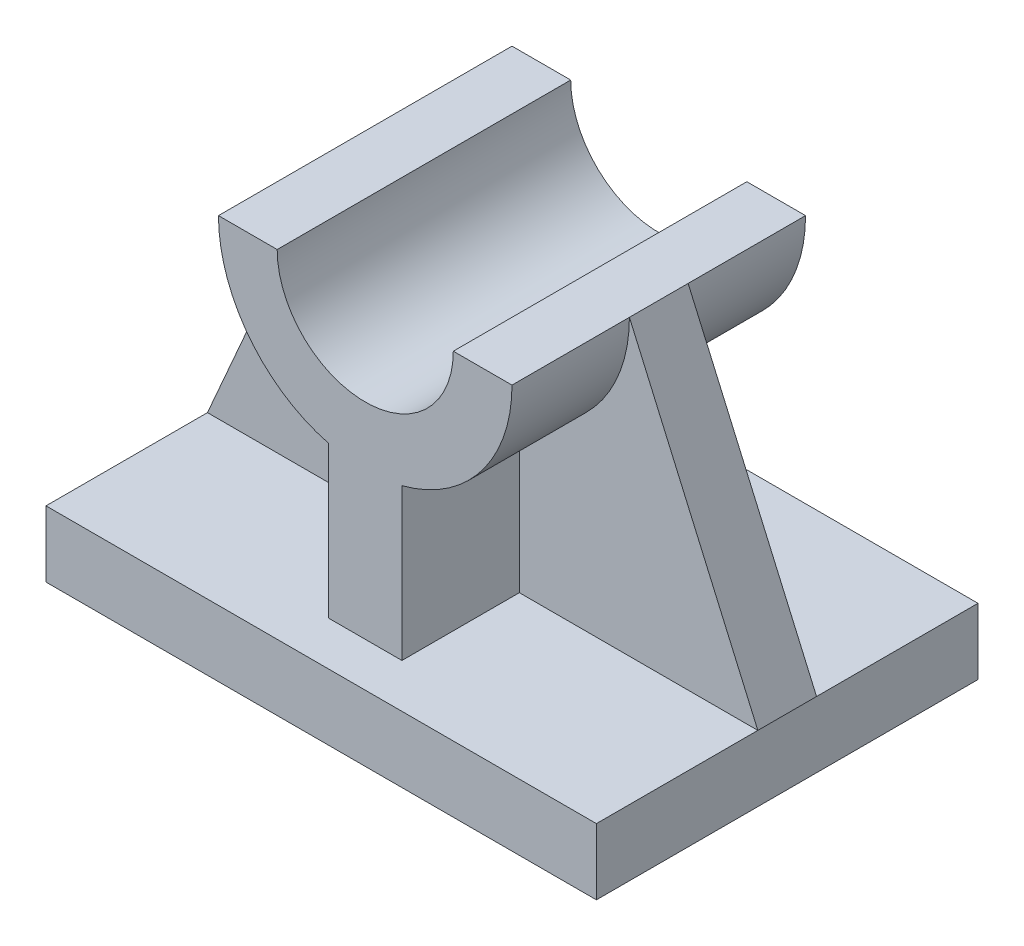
from build123d import *

# Parameters (mm, degrees)
EXTRUDE1_DEPTH = 26
EXTRUDE2_DEPTH = 20
EXTRUDE3_DEPTH = 4


with BuildPart() as part:
    # Sketch1 → Extrude1 (new, symmetric)
    with BuildSketch(Plane.XY):
        Polygon((-5, 0), (5, 0), (37.5, 0), (37.5, -9), (-37.5, -9), (-37.5, 0), align=None)
    extrude(amount=EXTRUDE1_DEPTH, both=True)

    # Sketch1_3 → Extrude2 (add, symmetric)
    with BuildSketch(Plane.XY):
        with BuildLine():
            Line((5, 0), (5, 20.635083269))
            ThreePointArc((5, 20.635083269), (15.811388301, 27.752551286), (20, 40))
            Line((20, 40), (12, 40))
            ThreePointArc((12, 40), (0, 28), (-12, 40))
            Line((-12, 40), (-20, 40))
            ThreePointArc((-20, 40), (-15.811388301, 27.752551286), (-5, 20.635083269))
            Line((-5, 20.635083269), (-5, 0))
            Line((-5, 0), (5, 0))
        make_face()
    extrude(amount=EXTRUDE2_DEPTH, both=True)

    # Sketch1_4 → Extrude3 (add, symmetric)
    with BuildSketch(Plane.XY):
        with BuildLine():
            ThreePointArc((5, 20.635083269), (15.811388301, 27.752551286), (20, 40))
            Line((20, 40), (37.5, 0))
            Line((37.5, 0), (5, 0))
            Line((5, 0), (5, 20.635083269))
        make_face()
        with BuildLine():
            ThreePointArc((-20, 40), (-15.811388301, 27.752551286), (-5, 20.635083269))
            Line((-5, 20.635083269), (-5, 0))
            Line((-5, 0), (-37.5, 0))
            Line((-37.5, 0), (-20, 40))
        make_face()
    extrude(amount=EXTRUDE3_DEPTH, both=True)


solid = part.part
